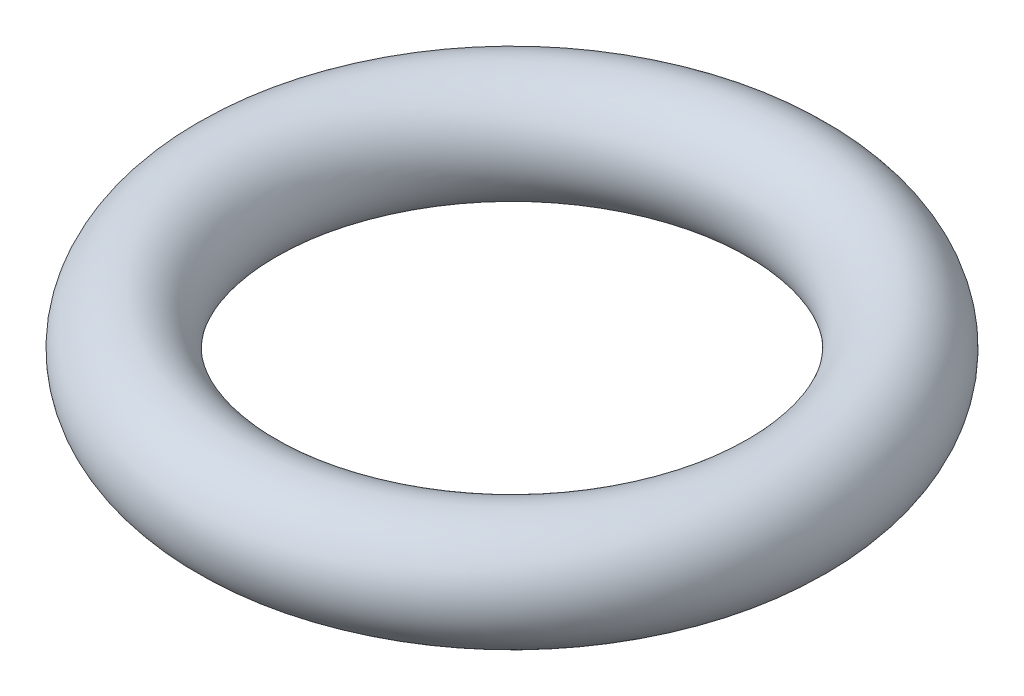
ISO-10303-21;
HEADER;
FILE_DESCRIPTION(('STEP AP214'),'2;1');
FILE_NAME('part.step','',(''),(''),'','','');
FILE_SCHEMA(('AUTOMOTIVE_DESIGN { 1 0 10303 214 1 1 1 1 }'));
ENDSEC;
DATA;
#1=APPLICATION_CONTEXT('core data for automotive mechanical design processes');
#2=APPLICATION_PROTOCOL_DEFINITION('international standard','automotive_design',2000,#1);
#3=PRODUCT_CONTEXT('',#1,'mechanical');
#4=PRODUCT('Part','Part','',(#3));
#5=PRODUCT_RELATED_PRODUCT_CATEGORY('part','',(#4));
#6=PRODUCT_DEFINITION_FORMATION('','',#4);
#7=PRODUCT_DEFINITION_CONTEXT('part definition',#1,'design');
#8=PRODUCT_DEFINITION('design','',#6,#7);
#9=PRODUCT_DEFINITION_SHAPE('','',#8);
#10=(LENGTH_UNIT() NAMED_UNIT(*) SI_UNIT(.MILLI.,.METRE.));
#11=(NAMED_UNIT(*) PLANE_ANGLE_UNIT() SI_UNIT($,.RADIAN.));
#12=(NAMED_UNIT(*) SI_UNIT($,.STERADIAN.) SOLID_ANGLE_UNIT());
#13=UNCERTAINTY_MEASURE_WITH_UNIT(LENGTH_MEASURE(1.E-05),#10,'distance_accuracy_value','');
#14=(GEOMETRIC_REPRESENTATION_CONTEXT(3) GLOBAL_UNCERTAINTY_ASSIGNED_CONTEXT((#13)) GLOBAL_UNIT_ASSIGNED_CONTEXT((#10,
#11,#12)) REPRESENTATION_CONTEXT('',''));
#15=CARTESIAN_POINT('',(0.,0.,0.));
#16=DIRECTION('',(0.,0.,1.));
#17=DIRECTION('',(1.,0.,0.));
#18=AXIS2_PLACEMENT_3D('',#15,#16,#17);
#19=CARTESIAN_POINT('',(0.,0.499999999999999,0.));
#20=DIRECTION('',(0.,0.999999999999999,0.));
#21=DIRECTION('',(-1.,0.,0.));
#22=AXIS2_PLACEMENT_3D('',#19,#20,#21);
#23=TOROIDAL_SURFACE('',#22,2.5,0.5);
#24=CARTESIAN_POINT('',(-3.,0.499999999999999,0.));
#25=VERTEX_POINT('',#24);
#26=VERTEX_LOOP('',#25);
#27=FACE_BOUND('',#26,.T.);
#28=ADVANCED_FACE('F28',(#27),#23,.T.);
#29=CLOSED_SHELL('',(#28));
#30=MANIFOLD_SOLID_BREP('B2',#29);
#31=ADVANCED_BREP_SHAPE_REPRESENTATION('',(#18,#30),#14);
#32=SHAPE_DEFINITION_REPRESENTATION(#9,#31);
ENDSEC;
END-ISO-10303-21;
